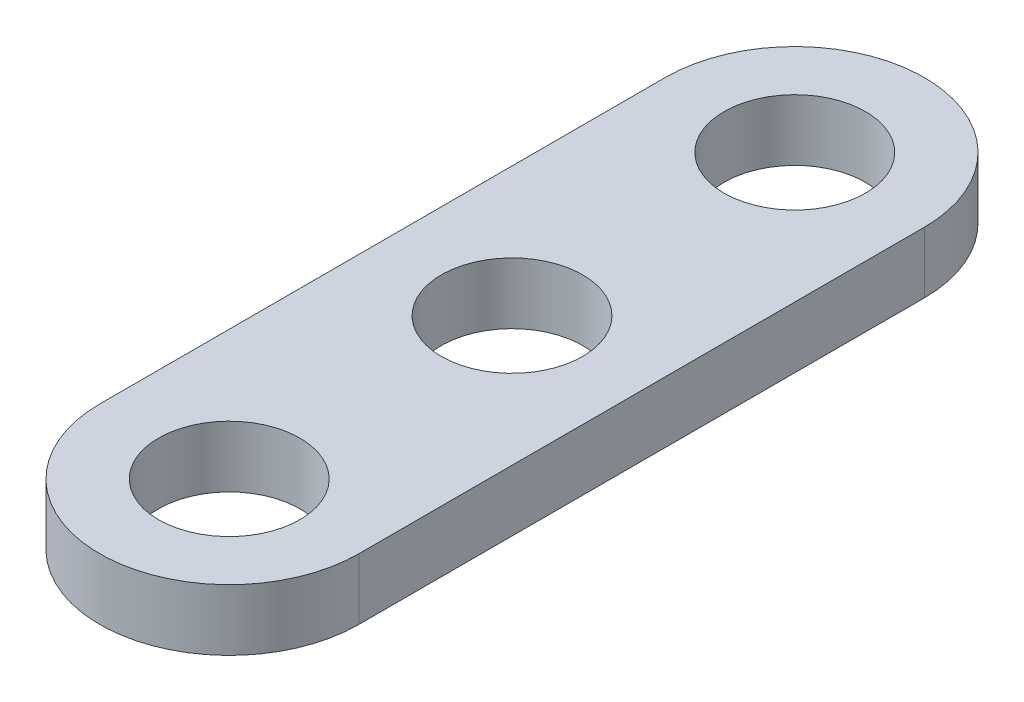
from build123d import *

# Parameters (mm, degrees)
SKETCH_1_R      = 3
EXTRUDE_1_DEPTH = 2.6


with BuildPart() as part:
    # Sketch 1 → Extrude 1 (new body)
    with BuildSketch(Plane(origin=(0, 0, 0), x_dir=(1, 0, 0), z_dir=(0, 1, 0))):
        with BuildLine():
            Line((-5.5, -12), (-5.5, 12))
            ThreePointArc((-5.5, 12), (0, 17.5), (5.5, 12))
            Line((5.5, 12), (5.5, -12))
            ThreePointArc((5.5, -12), (0, -17.5), (-5.5, -12))
        make_face()
        with Locations(Location((0, 12, 0), (0, 0, 270))):
            Circle(SKETCH_1_R, mode=Mode.SUBTRACT)
        with Locations(Location((0, 0, 0), (0, 0, 270))):
            Circle(SKETCH_1_R, mode=Mode.SUBTRACT)
        with Locations(Location((0, -12, 0), (0, 0, 270))):
            Circle(SKETCH_1_R, mode=Mode.SUBTRACT)
    extrude(amount=EXTRUDE_1_DEPTH)


solid = part.part
